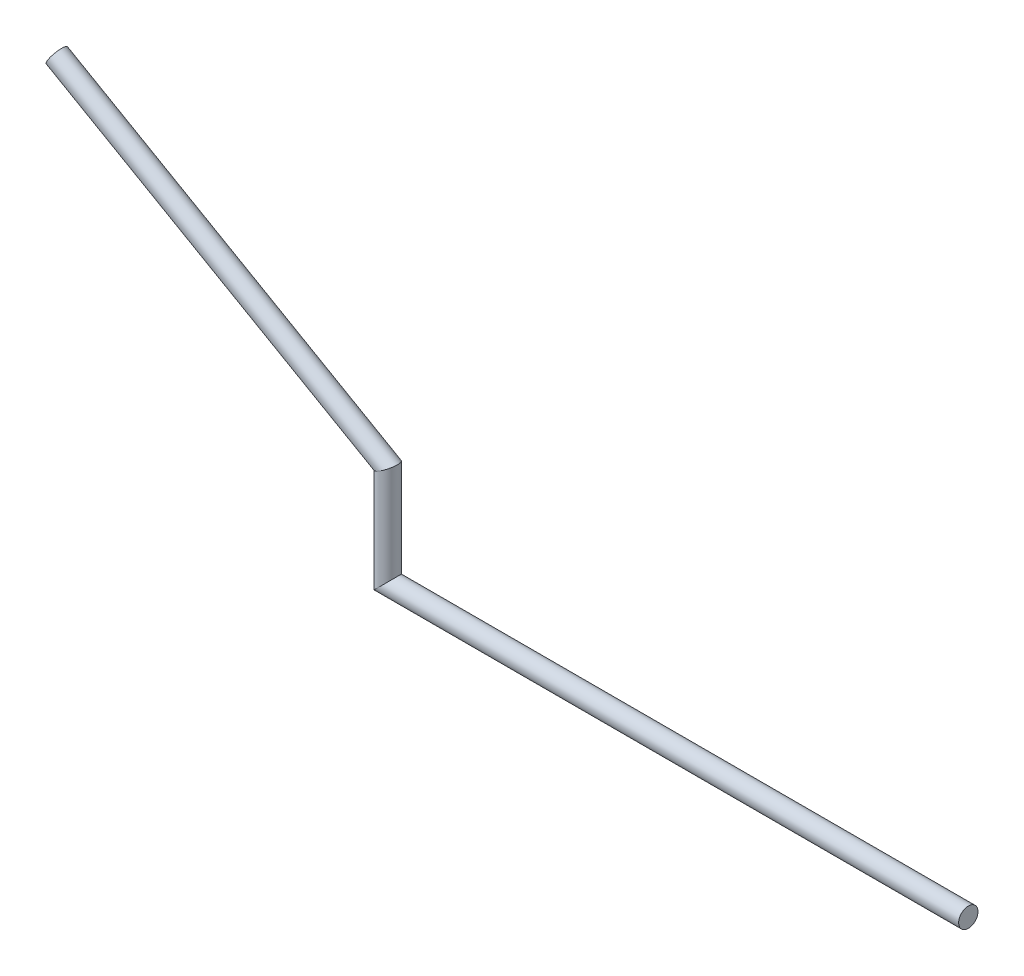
ISO-10303-21;
HEADER;
FILE_DESCRIPTION(('STEP AP214'),'2;1');
FILE_NAME('part.step','',(''),(''),'','','');
FILE_SCHEMA(('AUTOMOTIVE_DESIGN { 1 0 10303 214 1 1 1 1 }'));
ENDSEC;
DATA;
#1=APPLICATION_CONTEXT('core data for automotive mechanical design processes');
#2=APPLICATION_PROTOCOL_DEFINITION('international standard','automotive_design',2000,#1);
#3=PRODUCT_CONTEXT('',#1,'mechanical');
#4=PRODUCT('Part','Part','',(#3));
#5=PRODUCT_RELATED_PRODUCT_CATEGORY('part','',(#4));
#6=PRODUCT_DEFINITION_FORMATION('','',#4);
#7=PRODUCT_DEFINITION_CONTEXT('part definition',#1,'design');
#8=PRODUCT_DEFINITION('design','',#6,#7);
#9=PRODUCT_DEFINITION_SHAPE('','',#8);
#10=(LENGTH_UNIT() NAMED_UNIT(*) SI_UNIT(.MILLI.,.METRE.));
#11=(NAMED_UNIT(*) PLANE_ANGLE_UNIT() SI_UNIT($,.RADIAN.));
#12=(NAMED_UNIT(*) SI_UNIT($,.STERADIAN.) SOLID_ANGLE_UNIT());
#13=UNCERTAINTY_MEASURE_WITH_UNIT(LENGTH_MEASURE(1.E-05),#10,'distance_accuracy_value','');
#14=(GEOMETRIC_REPRESENTATION_CONTEXT(3) GLOBAL_UNCERTAINTY_ASSIGNED_CONTEXT((#13)) GLOBAL_UNIT_ASSIGNED_CONTEXT((#10,
#11,#12)) REPRESENTATION_CONTEXT('',''));
#15=CARTESIAN_POINT('',(0.,0.,0.));
#16=DIRECTION('',(0.,0.,1.));
#17=DIRECTION('',(1.,0.,0.));
#18=AXIS2_PLACEMENT_3D('',#15,#16,#17);
#19=CARTESIAN_POINT('',(-76.2,13.2301065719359,0.));
#20=DIRECTION('',(-0.86737106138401,0.497661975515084,0.));
#21=DIRECTION('',(-0.497661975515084,-0.86737106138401,0.));
#22=AXIS2_PLACEMENT_3D('',#19,#20,#21);
#23=CYLINDRICAL_SURFACE('',#22,1.27);
#24=CARTESIAN_POINT('',(-76.2,13.2301065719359,0.));
#25=DIRECTION('',(-0.501167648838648,0.865350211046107,0.));
#26=DIRECTION('',(0.865350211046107,0.501167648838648,0.));
#27=AXIS2_PLACEMENT_3D('',#24,#25,#26);
#28=ELLIPSE('',#27,1.46761390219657,1.27);
#29=CARTESIAN_POINT('',(-74.93,13.9656271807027,0.));
#30=VERTEX_POINT('',#29);
#31=EDGE_CURVE('E38',#30,#30,#28,.T.);
#32=ORIENTED_EDGE('',*,*,#31,.T.);
#33=EDGE_LOOP('',(#32));
#34=FACE_BOUND('',#33,.T.);
#35=CARTESIAN_POINT('',(-119.643826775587,38.1563943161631,0.));
#36=DIRECTION('',(-0.86737106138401,0.497661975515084,0.));
#37=DIRECTION('',(-0.497661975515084,-0.86737106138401,0.));
#38=AXIS2_PLACEMENT_3D('',#35,#36,#37);
#39=CIRCLE('',#38,1.27);
#40=CARTESIAN_POINT('',(-120.275857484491,37.0548330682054,0.));
#41=VERTEX_POINT('',#40);
#42=EDGE_CURVE('E11',#41,#41,#39,.F.);
#43=ORIENTED_EDGE('',*,*,#42,.T.);
#44=EDGE_LOOP('',(#43));
#45=FACE_BOUND('',#44,.T.);
#46=ADVANCED_FACE('F32',(#34,#45),#23,.T.);
#47=CARTESIAN_POINT('',(-76.2,0.,0.));
#48=DIRECTION('',(0.,1.,0.));
#49=DIRECTION('',(0.,0.,1.));
#50=AXIS2_PLACEMENT_3D('',#47,#48,#49);
#51=CYLINDRICAL_SURFACE('',#50,1.27);
#52=CARTESIAN_POINT('',(-76.2,0.,0.));
#53=DIRECTION('',(-0.707106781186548,0.707106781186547,0.));
#54=DIRECTION('',(0.707106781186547,0.707106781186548,0.));
#55=AXIS2_PLACEMENT_3D('',#52,#53,#54);
#56=ELLIPSE('',#55,1.79605122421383,1.27);
#57=CARTESIAN_POINT('',(-74.93,1.26999999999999,0.));
#58=VERTEX_POINT('',#57);
#59=EDGE_CURVE('E42',#58,#58,#56,.F.);
#60=ORIENTED_EDGE('',*,*,#59,.F.);
#61=EDGE_LOOP('',(#60));
#62=FACE_BOUND('',#61,.T.);
#63=ORIENTED_EDGE('',*,*,#31,.F.);
#64=EDGE_LOOP('',(#63));
#65=FACE_BOUND('',#64,.T.);
#66=ADVANCED_FACE('F61',(#62,#65),#51,.T.);
#67=CARTESIAN_POINT('',(0.,0.,0.));
#68=DIRECTION('',(1.,0.,0.));
#69=DIRECTION('',(0.,0.,-1.));
#70=AXIS2_PLACEMENT_3D('',#67,#68,#69);
#71=PLANE('',#70);
#72=CARTESIAN_POINT('',(0.,0.,0.));
#73=DIRECTION('',(1.,0.,0.));
#74=DIRECTION('',(0.,0.,-1.));
#75=AXIS2_PLACEMENT_3D('',#72,#73,#74);
#76=CIRCLE('',#75,1.27);
#77=CARTESIAN_POINT('',(0.,0.,-1.27));
#78=VERTEX_POINT('',#77);
#79=EDGE_CURVE('E46',#78,#78,#76,.T.);
#80=ORIENTED_EDGE('',*,*,#79,.T.);
#81=EDGE_LOOP('',(#80));
#82=FACE_BOUND('',#81,.T.);
#83=ADVANCED_FACE('F52',(#82),#71,.T.);
#84=CARTESIAN_POINT('',(-79.7921024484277,0.,0.));
#85=DIRECTION('',(1.,0.,0.));
#86=DIRECTION('',(0.,1.,0.));
#87=AXIS2_PLACEMENT_3D('',#84,#85,#86);
#88=CYLINDRICAL_SURFACE('',#87,1.27);
#89=ORIENTED_EDGE('',*,*,#79,.F.);
#90=EDGE_LOOP('',(#89));
#91=FACE_BOUND('',#90,.T.);
#92=ORIENTED_EDGE('',*,*,#59,.T.);
#93=EDGE_LOOP('',(#92));
#94=FACE_BOUND('',#93,.T.);
#95=ADVANCED_FACE('F54',(#91,#94),#88,.T.);
#96=CARTESIAN_POINT('',(-119.643826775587,38.1563943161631,0.));
#97=DIRECTION('',(-0.86737106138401,0.497661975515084,0.));
#98=DIRECTION('',(-0.497661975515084,-0.86737106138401,0.));
#99=AXIS2_PLACEMENT_3D('',#96,#97,#98);
#100=PLANE('',#99);
#101=ORIENTED_EDGE('',*,*,#42,.F.);
#102=EDGE_LOOP('',(#101));
#103=FACE_BOUND('',#102,.T.);
#104=ADVANCED_FACE('F57',(#103),#100,.T.);
#105=CLOSED_SHELL('',(#46,#66,#83,#95,#104));
#106=MANIFOLD_SOLID_BREP('B2',#105);
#107=ADVANCED_BREP_SHAPE_REPRESENTATION('',(#18,#106),#14);
#108=SHAPE_DEFINITION_REPRESENTATION(#9,#107);
ENDSEC;
END-ISO-10303-21;
